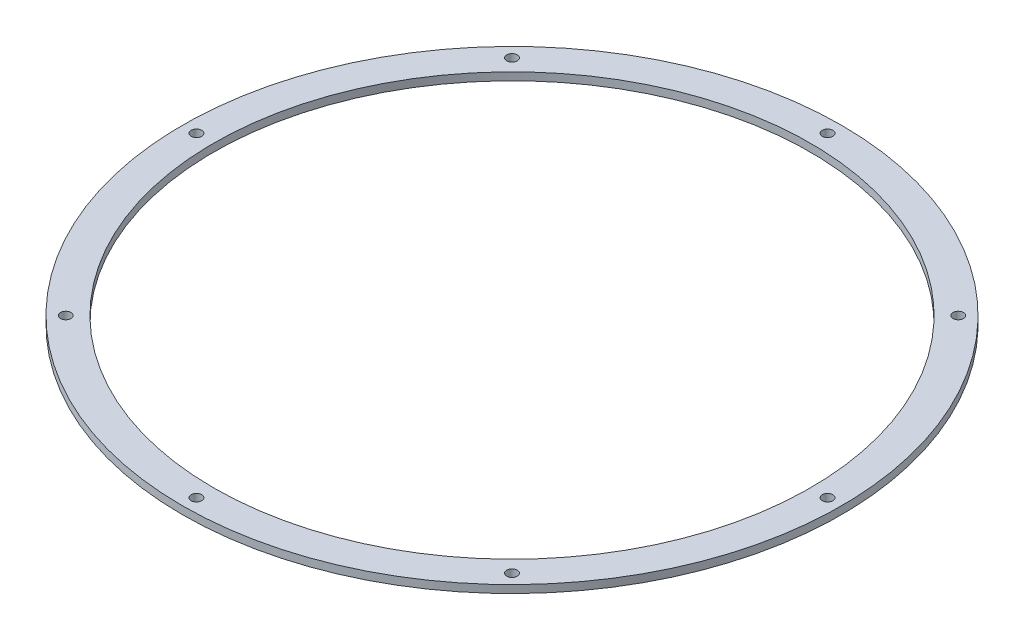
from build123d import *

# Parameters (mm, degrees)
SKETCH1_R            = 134.62
SKETCH1_R_2          = 121.92
BOSS_EXTRUDE1_DEPTH  = 3.175
M4_CLEARANCE_HOLE1_D = 4.3
CIRPATTERN1_COUNT    = 8


with BuildPart() as part:
    # Sketch1 → Boss-Extrude1 (new body)
    with BuildSketch(Plane(origin=(0, 0, 0), x_dir=(1, 0, 0), z_dir=(0, 1, 0))):
        with Locations(Location((0, 0, 0), (0, 0, 270))):
            Circle(SKETCH1_R)
        with Locations(Location((0, 0, 0), (0, 0, 270))):
            Circle(SKETCH1_R_2, mode=Mode.SUBTRACT)
    extrude(amount=BOSS_EXTRUDE1_DEPTH)

    # M4 Clearance Hole1 (through all)
    with Locations(Plane(origin=(0, 3.175, 0), x_dir=(1, 0, 0), z_dir=(0, 1, 0))):
        with Locations((0, 128.905)):
            m4_clearance_hole1 = Hole(M4_CLEARANCE_HOLE1_D / 2)

    # CirPattern1: M4 Clearance Hole1 ×8 about axis
    cirpattern1_axis = Axis((0, 0, 0), (0, 1, 0))
    for i in range(1, CIRPATTERN1_COUNT):
        add(m4_clearance_hole1.rotate(cirpattern1_axis, i * 360 / CIRPATTERN1_COUNT), mode=Mode.SUBTRACT)


solid = part.part
